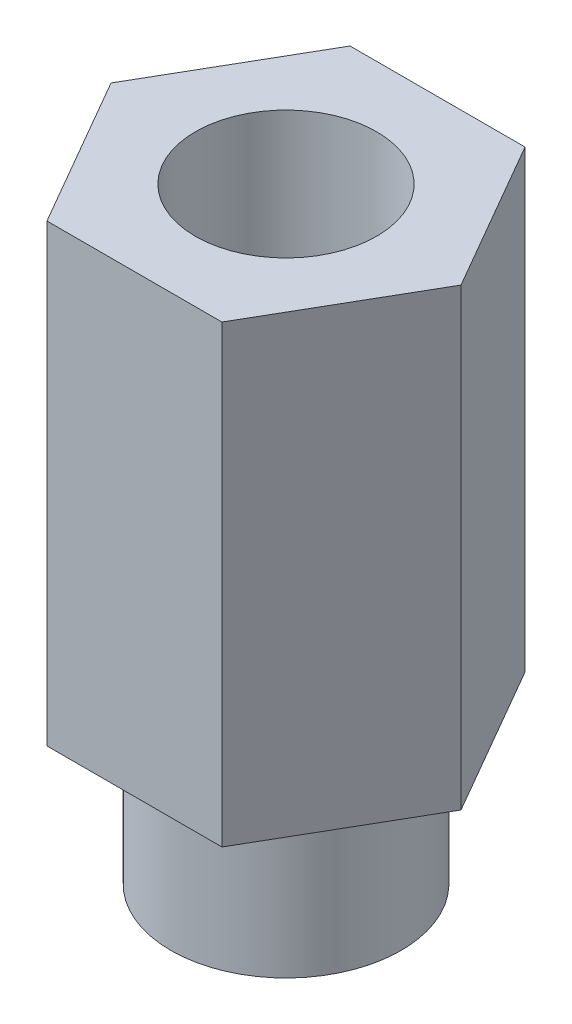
ISO-10303-21;
HEADER;
FILE_DESCRIPTION(('STEP AP214'),'2;1');
FILE_NAME('part.step','',(''),(''),'','','');
FILE_SCHEMA(('AUTOMOTIVE_DESIGN { 1 0 10303 214 1 1 1 1 }'));
ENDSEC;
DATA;
#1=APPLICATION_CONTEXT('core data for automotive mechanical design processes');
#2=APPLICATION_PROTOCOL_DEFINITION('international standard','automotive_design',2000,#1);
#3=PRODUCT_CONTEXT('',#1,'mechanical');
#4=PRODUCT('Part','Part','',(#3));
#5=PRODUCT_RELATED_PRODUCT_CATEGORY('part','',(#4));
#6=PRODUCT_DEFINITION_FORMATION('','',#4);
#7=PRODUCT_DEFINITION_CONTEXT('part definition',#1,'design');
#8=PRODUCT_DEFINITION('design','',#6,#7);
#9=PRODUCT_DEFINITION_SHAPE('','',#8);
#10=(LENGTH_UNIT() NAMED_UNIT(*) SI_UNIT(.MILLI.,.METRE.));
#11=(NAMED_UNIT(*) PLANE_ANGLE_UNIT() SI_UNIT($,.RADIAN.));
#12=(NAMED_UNIT(*) SI_UNIT($,.STERADIAN.) SOLID_ANGLE_UNIT());
#13=UNCERTAINTY_MEASURE_WITH_UNIT(LENGTH_MEASURE(1.E-05),#10,'distance_accuracy_value','');
#14=(GEOMETRIC_REPRESENTATION_CONTEXT(3) GLOBAL_UNCERTAINTY_ASSIGNED_CONTEXT((#13)) GLOBAL_UNIT_ASSIGNED_CONTEXT((#10,
#11,#12)) REPRESENTATION_CONTEXT('',''));
#15=CARTESIAN_POINT('',(0.,0.,0.));
#16=DIRECTION('',(0.,0.,1.));
#17=DIRECTION('',(1.,0.,0.));
#18=AXIS2_PLACEMENT_3D('',#15,#16,#17);
#19=CARTESIAN_POINT('',(0.,-3.175,0.));
#20=DIRECTION('',(0.,1.,0.));
#21=DIRECTION('',(0.,0.,1.));
#22=AXIS2_PLACEMENT_3D('',#19,#20,#21);
#23=CYLINDRICAL_SURFACE('',#22,2.413);
#24=CARTESIAN_POINT('',(0.,-3.175,0.));
#25=DIRECTION('',(0.,1.,0.));
#26=DIRECTION('',(0.,0.,1.));
#27=AXIS2_PLACEMENT_3D('',#24,#25,#26);
#28=CIRCLE('',#27,2.413);
#29=CARTESIAN_POINT('',(0.,-3.175,2.413));
#30=VERTEX_POINT('',#29);
#31=EDGE_CURVE('E11',#30,#30,#28,.T.);
#32=ORIENTED_EDGE('',*,*,#31,.T.);
#33=EDGE_LOOP('',(#32));
#34=FACE_BOUND('',#33,.T.);
#35=CARTESIAN_POINT('',(0.,0.,0.));
#36=DIRECTION('',(0.,1.,0.));
#37=DIRECTION('',(0.,0.,1.));
#38=AXIS2_PLACEMENT_3D('',#35,#36,#37);
#39=CIRCLE('',#38,2.413);
#40=CARTESIAN_POINT('',(0.,0.,2.413));
#41=VERTEX_POINT('',#40);
#42=EDGE_CURVE('E41',#41,#41,#39,.T.);
#43=ORIENTED_EDGE('',*,*,#42,.F.);
#44=EDGE_LOOP('',(#43));
#45=FACE_BOUND('',#44,.T.);
#46=ADVANCED_FACE('F38',(#34,#45),#23,.T.);
#47=CARTESIAN_POINT('',(0.,-3.175,0.));
#48=DIRECTION('',(0.,1.,0.));
#49=DIRECTION('',(0.,0.,1.));
#50=AXIS2_PLACEMENT_3D('',#47,#48,#49);
#51=PLANE('',#50);
#52=ORIENTED_EDGE('',*,*,#31,.F.);
#53=EDGE_LOOP('',(#52));
#54=FACE_BOUND('',#53,.T.);
#55=ADVANCED_FACE('F152',(#54),#51,.F.);
#56=CARTESIAN_POINT('',(1.83308710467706,9.525,3.175));
#57=DIRECTION('',(-0.866025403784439,0.,-0.5));
#58=DIRECTION('',(-0.5,0.,0.866025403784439));
#59=AXIS2_PLACEMENT_3D('',#56,#57,#58);
#60=PLANE('',#59);
#61=DIRECTION('',(0.5,0.,-0.866025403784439));
#62=VECTOR('',#61,1.);
#63=CARTESIAN_POINT('',(1.83308710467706,0.,3.175));
#64=LINE('',#63,#62);
#65=CARTESIAN_POINT('',(1.83308710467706,0.,3.175));
#66=VERTEX_POINT('',#65);
#67=CARTESIAN_POINT('',(3.66617420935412,0.,0.));
#68=VERTEX_POINT('',#67);
#69=EDGE_CURVE('E125',#66,#68,#64,.T.);
#70=ORIENTED_EDGE('',*,*,#69,.T.);
#71=DIRECTION('',(0.,-1.,0.));
#72=VECTOR('',#71,1.);
#73=CARTESIAN_POINT('',(3.66617420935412,9.525,0.));
#74=LINE('',#73,#72);
#75=CARTESIAN_POINT('',(3.66617420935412,9.525,0.));
#76=VERTEX_POINT('',#75);
#77=EDGE_CURVE('E143',#76,#68,#74,.T.);
#78=ORIENTED_EDGE('',*,*,#77,.F.);
#79=DIRECTION('',(0.5,0.,-0.866025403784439));
#80=VECTOR('',#79,1.);
#81=CARTESIAN_POINT('',(1.83308710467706,9.525,3.175));
#82=LINE('',#81,#80);
#83=CARTESIAN_POINT('',(1.83308710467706,9.525,3.175));
#84=VERTEX_POINT('',#83);
#85=EDGE_CURVE('E136',#84,#76,#82,.T.);
#86=ORIENTED_EDGE('',*,*,#85,.F.);
#87=DIRECTION('',(0.,-1.,0.));
#88=VECTOR('',#87,1.);
#89=CARTESIAN_POINT('',(1.83308710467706,9.525,3.175));
#90=LINE('',#89,#88);
#91=EDGE_CURVE('E121',#84,#66,#90,.T.);
#92=ORIENTED_EDGE('',*,*,#91,.T.);
#93=EDGE_LOOP('',(#70,#78,#86,#92));
#94=FACE_BOUND('',#93,.T.);
#95=ADVANCED_FACE('F156',(#94),#60,.F.);
#96=CARTESIAN_POINT('',(3.66617420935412,9.525,0.));
#97=DIRECTION('',(-0.866025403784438,0.,0.5));
#98=DIRECTION('',(0.5,0.,0.866025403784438));
#99=AXIS2_PLACEMENT_3D('',#96,#97,#98);
#100=PLANE('',#99);
#101=DIRECTION('',(-0.5,0.,-0.866025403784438));
#102=VECTOR('',#101,1.);
#103=CARTESIAN_POINT('',(3.66617420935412,0.,0.));
#104=LINE('',#103,#102);
#105=CARTESIAN_POINT('',(1.83308710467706,0.,-3.175));
#106=VERTEX_POINT('',#105);
#107=EDGE_CURVE('E128',#68,#106,#104,.T.);
#108=ORIENTED_EDGE('',*,*,#107,.T.);
#109=DIRECTION('',(0.,-1.,0.));
#110=VECTOR('',#109,1.);
#111=CARTESIAN_POINT('',(1.83308710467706,9.525,-3.175));
#112=LINE('',#111,#110);
#113=CARTESIAN_POINT('',(1.83308710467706,9.525,-3.175));
#114=VERTEX_POINT('',#113);
#115=EDGE_CURVE('E140',#114,#106,#112,.T.);
#116=ORIENTED_EDGE('',*,*,#115,.F.);
#117=DIRECTION('',(-0.5,0.,-0.866025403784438));
#118=VECTOR('',#117,1.);
#119=CARTESIAN_POINT('',(3.66617420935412,9.525,0.));
#120=LINE('',#119,#118);
#121=EDGE_CURVE('E93',#76,#114,#120,.T.);
#122=ORIENTED_EDGE('',*,*,#121,.F.);
#123=ORIENTED_EDGE('',*,*,#77,.T.);
#124=EDGE_LOOP('',(#108,#116,#122,#123));
#125=FACE_BOUND('',#124,.T.);
#126=ADVANCED_FACE('F162',(#125),#100,.F.);
#127=CARTESIAN_POINT('',(1.83308710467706,9.525,-3.175));
#128=DIRECTION('',(0.,0.,1.));
#129=DIRECTION('',(1.,0.,0.));
#130=AXIS2_PLACEMENT_3D('',#127,#128,#129);
#131=PLANE('',#130);
#132=DIRECTION('',(-1.,0.,0.));
#133=VECTOR('',#132,1.);
#134=CARTESIAN_POINT('',(1.83308710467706,0.,-3.175));
#135=LINE('',#134,#133);
#136=CARTESIAN_POINT('',(-1.83308710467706,0.,-3.175));
#137=VERTEX_POINT('',#136);
#138=EDGE_CURVE('E131',#106,#137,#135,.T.);
#139=ORIENTED_EDGE('',*,*,#138,.T.);
#140=DIRECTION('',(0.,-1.,0.));
#141=VECTOR('',#140,1.);
#142=CARTESIAN_POINT('',(-1.83308710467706,9.525,-3.175));
#143=LINE('',#142,#141);
#144=CARTESIAN_POINT('',(-1.83308710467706,9.525,-3.175));
#145=VERTEX_POINT('',#144);
#146=EDGE_CURVE('E116',#145,#137,#143,.T.);
#147=ORIENTED_EDGE('',*,*,#146,.F.);
#148=DIRECTION('',(-1.,0.,0.));
#149=VECTOR('',#148,1.);
#150=CARTESIAN_POINT('',(1.83308710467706,9.525,-3.175));
#151=LINE('',#150,#149);
#152=EDGE_CURVE('E107',#114,#145,#151,.T.);
#153=ORIENTED_EDGE('',*,*,#152,.F.);
#154=ORIENTED_EDGE('',*,*,#115,.T.);
#155=EDGE_LOOP('',(#139,#147,#153,#154));
#156=FACE_BOUND('',#155,.T.);
#157=ADVANCED_FACE('F168',(#156),#131,.F.);
#158=CARTESIAN_POINT('',(-1.83308710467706,9.525,-3.175));
#159=DIRECTION('',(0.866025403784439,0.,0.5));
#160=DIRECTION('',(0.5,0.,-0.866025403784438));
#161=AXIS2_PLACEMENT_3D('',#158,#159,#160);
#162=PLANE('',#161);
#163=DIRECTION('',(-0.5,0.,0.866025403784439));
#164=VECTOR('',#163,1.);
#165=CARTESIAN_POINT('',(-1.83308710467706,0.,-3.175));
#166=LINE('',#165,#164);
#167=CARTESIAN_POINT('',(-3.66617420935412,0.,0.));
#168=VERTEX_POINT('',#167);
#169=EDGE_CURVE('E115',#137,#168,#166,.T.);
#170=ORIENTED_EDGE('',*,*,#169,.T.);
#171=DIRECTION('',(0.,-1.,0.));
#172=VECTOR('',#171,1.);
#173=CARTESIAN_POINT('',(-3.66617420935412,9.525,0.));
#174=LINE('',#173,#172);
#175=CARTESIAN_POINT('',(-3.66617420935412,9.525,0.));
#176=VERTEX_POINT('',#175);
#177=EDGE_CURVE('E112',#176,#168,#174,.T.);
#178=ORIENTED_EDGE('',*,*,#177,.F.);
#179=DIRECTION('',(-0.5,0.,0.866025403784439));
#180=VECTOR('',#179,1.);
#181=CARTESIAN_POINT('',(-1.83308710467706,9.525,-3.175));
#182=LINE('',#181,#180);
#183=EDGE_CURVE('E101',#145,#176,#182,.T.);
#184=ORIENTED_EDGE('',*,*,#183,.F.);
#185=ORIENTED_EDGE('',*,*,#146,.T.);
#186=EDGE_LOOP('',(#170,#178,#184,#185));
#187=FACE_BOUND('',#186,.T.);
#188=ADVANCED_FACE('F113',(#187),#162,.F.);
#189=CARTESIAN_POINT('',(-3.66617420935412,9.525,0.));
#190=DIRECTION('',(0.866025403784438,0.,-0.5));
#191=DIRECTION('',(-0.5,0.,-0.866025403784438));
#192=AXIS2_PLACEMENT_3D('',#189,#190,#191);
#193=PLANE('',#192);
#194=DIRECTION('',(0.5,0.,0.866025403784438));
#195=VECTOR('',#194,1.);
#196=CARTESIAN_POINT('',(-3.66617420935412,0.,0.));
#197=LINE('',#196,#195);
#198=CARTESIAN_POINT('',(-1.83308710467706,0.,3.175));
#199=VERTEX_POINT('',#198);
#200=EDGE_CURVE('E78',#168,#199,#197,.T.);
#201=ORIENTED_EDGE('',*,*,#200,.T.);
#202=DIRECTION('',(0.,-1.,0.));
#203=VECTOR('',#202,1.);
#204=CARTESIAN_POINT('',(-1.83308710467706,9.525,3.175));
#205=LINE('',#204,#203);
#206=CARTESIAN_POINT('',(-1.83308710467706,9.525,3.175));
#207=VERTEX_POINT('',#206);
#208=EDGE_CURVE('E117',#207,#199,#205,.T.);
#209=ORIENTED_EDGE('',*,*,#208,.F.);
#210=DIRECTION('',(0.5,0.,0.866025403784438));
#211=VECTOR('',#210,1.);
#212=CARTESIAN_POINT('',(-3.66617420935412,9.525,0.));
#213=LINE('',#212,#211);
#214=EDGE_CURVE('E105',#176,#207,#213,.T.);
#215=ORIENTED_EDGE('',*,*,#214,.F.);
#216=ORIENTED_EDGE('',*,*,#177,.T.);
#217=EDGE_LOOP('',(#201,#209,#215,#216));
#218=FACE_BOUND('',#217,.T.);
#219=ADVANCED_FACE('F119',(#218),#193,.F.);
#220=CARTESIAN_POINT('',(-1.83308710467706,9.525,3.175));
#221=DIRECTION('',(0.,0.,-1.));
#222=DIRECTION('',(-1.,0.,0.));
#223=AXIS2_PLACEMENT_3D('',#220,#221,#222);
#224=PLANE('',#223);
#225=DIRECTION('',(1.,0.,0.));
#226=VECTOR('',#225,1.);
#227=CARTESIAN_POINT('',(-1.83308710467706,0.,3.175));
#228=LINE('',#227,#226);
#229=EDGE_CURVE('E84',#199,#66,#228,.T.);
#230=ORIENTED_EDGE('',*,*,#229,.T.);
#231=ORIENTED_EDGE('',*,*,#91,.F.);
#232=DIRECTION('',(1.,0.,0.));
#233=VECTOR('',#232,1.);
#234=CARTESIAN_POINT('',(-1.83308710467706,9.525,3.175));
#235=LINE('',#234,#233);
#236=EDGE_CURVE('E54',#207,#84,#235,.T.);
#237=ORIENTED_EDGE('',*,*,#236,.F.);
#238=ORIENTED_EDGE('',*,*,#208,.T.);
#239=EDGE_LOOP('',(#230,#231,#237,#238));
#240=FACE_BOUND('',#239,.T.);
#241=ADVANCED_FACE('F176',(#240),#224,.F.);
#242=CARTESIAN_POINT('',(3.66617420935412,9.525,0.));
#243=DIRECTION('',(0.,1.,0.));
#244=DIRECTION('',(0.,0.,1.));
#245=AXIS2_PLACEMENT_3D('',#242,#243,#244);
#246=PLANE('',#245);
#247=CARTESIAN_POINT('',(0.,9.525,0.));
#248=DIRECTION('',(0.,1.,0.));
#249=DIRECTION('',(0.,0.,1.));
#250=AXIS2_PLACEMENT_3D('',#247,#248,#249);
#251=CIRCLE('',#250,1.89864999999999);
#252=CARTESIAN_POINT('',(0.,9.525,1.89864999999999));
#253=VERTEX_POINT('',#252);
#254=EDGE_CURVE('E198',#253,#253,#251,.T.);
#255=ORIENTED_EDGE('',*,*,#254,.F.);
#256=EDGE_LOOP('',(#255));
#257=FACE_BOUND('',#256,.T.);
#258=ORIENTED_EDGE('',*,*,#85,.T.);
#259=ORIENTED_EDGE('',*,*,#121,.T.);
#260=ORIENTED_EDGE('',*,*,#152,.T.);
#261=ORIENTED_EDGE('',*,*,#183,.T.);
#262=ORIENTED_EDGE('',*,*,#214,.T.);
#263=ORIENTED_EDGE('',*,*,#236,.T.);
#264=EDGE_LOOP('',(#258,#259,#260,#261,#262,#263));
#265=FACE_BOUND('',#264,.T.);
#266=ADVANCED_FACE('F103',(#257,#265),#246,.T.);
#267=CARTESIAN_POINT('',(3.66617420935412,0.,0.));
#268=DIRECTION('',(0.,1.,0.));
#269=DIRECTION('',(0.,0.,1.));
#270=AXIS2_PLACEMENT_3D('',#267,#268,#269);
#271=PLANE('',#270);
#272=ORIENTED_EDGE('',*,*,#42,.T.);
#273=EDGE_LOOP('',(#272));
#274=FACE_BOUND('',#273,.T.);
#275=ORIENTED_EDGE('',*,*,#69,.F.);
#276=ORIENTED_EDGE('',*,*,#229,.F.);
#277=ORIENTED_EDGE('',*,*,#200,.F.);
#278=ORIENTED_EDGE('',*,*,#169,.F.);
#279=ORIENTED_EDGE('',*,*,#138,.F.);
#280=ORIENTED_EDGE('',*,*,#107,.F.);
#281=EDGE_LOOP('',(#275,#276,#277,#278,#279,#280));
#282=FACE_BOUND('',#281,.T.);
#283=ADVANCED_FACE('F148',(#274,#282),#271,.F.);
#284=CARTESIAN_POINT('',(0.,0.,0.));
#285=DIRECTION('',(0.,1.,0.));
#286=DIRECTION('',(0.,0.,1.));
#287=AXIS2_PLACEMENT_3D('',#284,#285,#286);
#288=CONICAL_SURFACE('',#287,1.89865,1.02974425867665);
#289=CARTESIAN_POINT('',(0.,-1.14082401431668,0.));
#290=VERTEX_POINT('',#289);
#291=VERTEX_LOOP('',#290);
#292=FACE_BOUND('',#291,.T.);
#293=CARTESIAN_POINT('',(0.,0.,0.));
#294=DIRECTION('',(0.,1.,0.));
#295=DIRECTION('',(0.,0.,1.));
#296=AXIS2_PLACEMENT_3D('',#293,#294,#295);
#297=CIRCLE('',#296,1.89865);
#298=CARTESIAN_POINT('',(0.,0.,1.89865));
#299=VERTEX_POINT('',#298);
#300=EDGE_CURVE('E129',#299,#299,#297,.T.);
#301=ORIENTED_EDGE('',*,*,#300,.T.);
#302=EDGE_LOOP('',(#301));
#303=FACE_BOUND('',#302,.T.);
#304=ADVANCED_FACE('F181',(#292,#303),#288,.F.);
#305=CARTESIAN_POINT('',(0.,9.525,0.));
#306=DIRECTION('',(0.,1.,0.));
#307=DIRECTION('',(0.,0.,1.));
#308=AXIS2_PLACEMENT_3D('',#305,#306,#307);
#309=CYLINDRICAL_SURFACE('',#308,1.89864999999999);
#310=ORIENTED_EDGE('',*,*,#300,.F.);
#311=EDGE_LOOP('',(#310));
#312=FACE_BOUND('',#311,.T.);
#313=ORIENTED_EDGE('',*,*,#254,.T.);
#314=EDGE_LOOP('',(#313));
#315=FACE_BOUND('',#314,.T.);
#316=ADVANCED_FACE('F187',(#312,#315),#309,.F.);
#317=CLOSED_SHELL('',(#46,#55,#95,#126,#157,#188,#219,#241,#266,#283,#304,#316));
#318=MANIFOLD_SOLID_BREP('B2',#317);
#319=ADVANCED_BREP_SHAPE_REPRESENTATION('',(#18,#318),#14);
#320=SHAPE_DEFINITION_REPRESENTATION(#9,#319);
ENDSEC;
END-ISO-10303-21;
